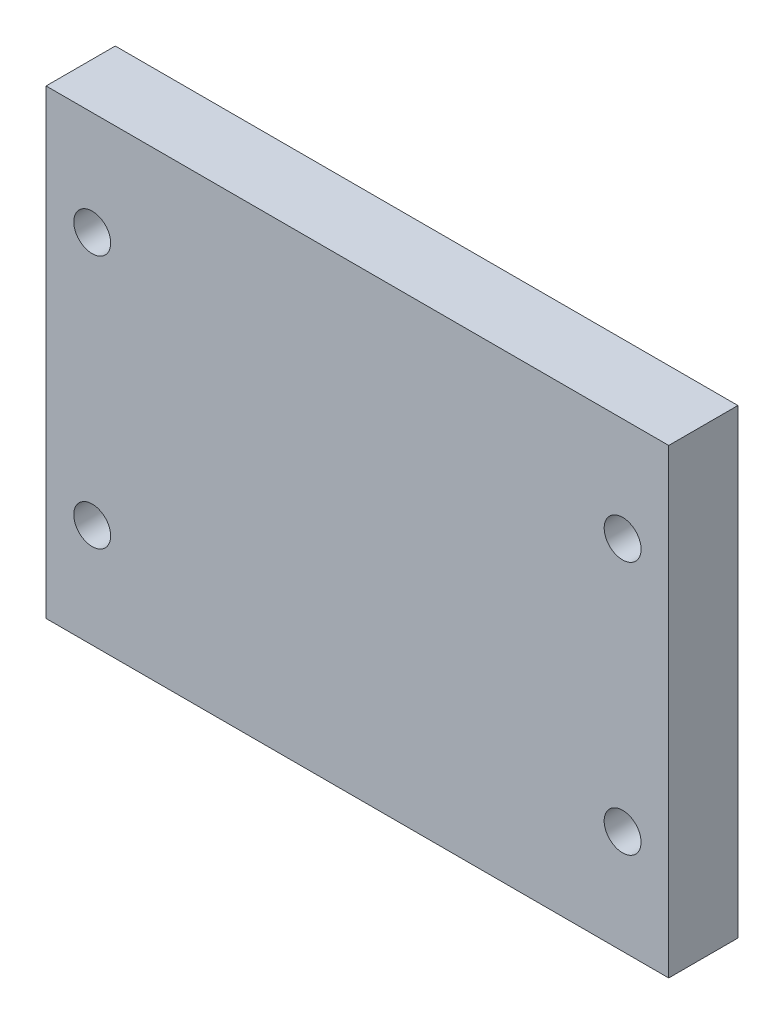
from build123d import *

# Parameters (mm, degrees)
ESQUISSE1_W        = 54
ESQUISSE1_H        = 40
ESQUISSE1_R        = 1.6
BOSS_EXTRU_1_DEPTH = 6


with BuildPart() as part:
    # Esquisse1 → Boss.-Extru.1 (new body)
    with BuildSketch(Plane.XY):
        with Locations((-8.481097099, -1.175692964)):
            Rectangle(ESQUISSE1_W, ESQUISSE1_H)
        with Locations((-31.481097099, 9.824307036)):
            Circle(ESQUISSE1_R, mode=Mode.SUBTRACT)
        with Locations(Location((14.518902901, 9.824307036, 0), (0, 0, 180))):
            Circle(ESQUISSE1_R, mode=Mode.SUBTRACT)
        with Locations((14.518902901, -12.175692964)):
            Circle(ESQUISSE1_R, mode=Mode.SUBTRACT)
        with Locations(Location((-31.481097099, -12.175692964, 0), (0, 0, 180))):
            Circle(ESQUISSE1_R, mode=Mode.SUBTRACT)
    extrude(amount=BOSS_EXTRU_1_DEPTH)


solid = part.part
